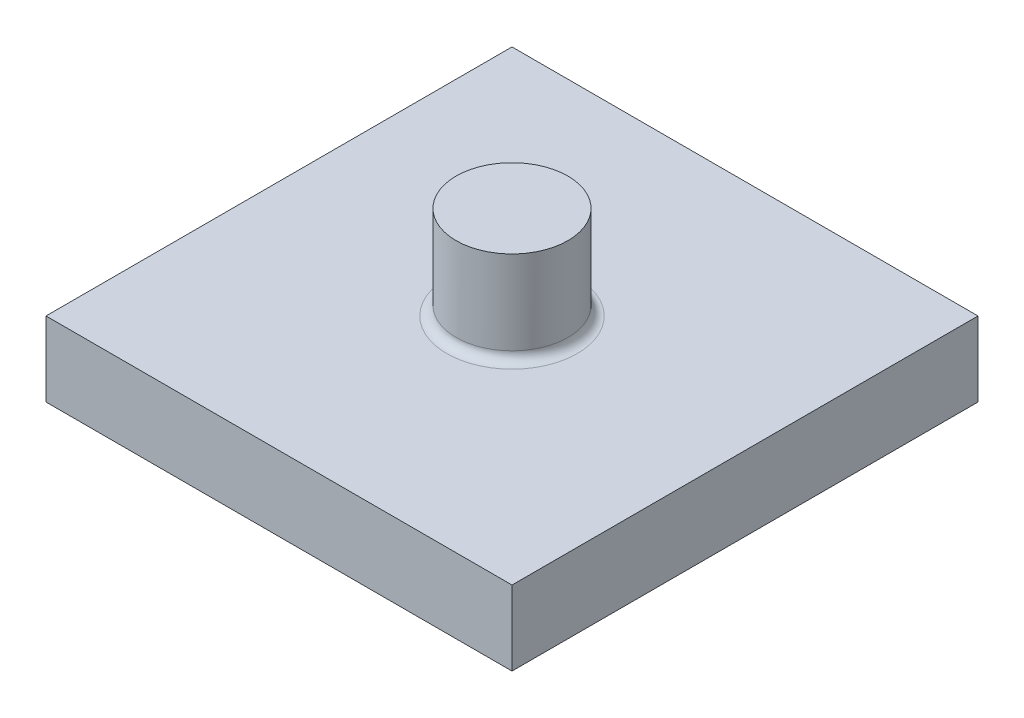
from build123d import *

# Parameters (mm, degrees)
CROQUIS1_W              = 25
CROQUIS1_H              = 25
SALIENTE_EXTRUIR1_DEPTH = 4
CROQUIS2_R              = 3
SALIENTE_EXTRUIR2_DEPTH = 5
REDONDEO1_R             = 0.5


with BuildPart() as part:
    # Croquis1 → Saliente-Extruir1 (new body)
    with BuildSketch(Plane(origin=(0, 0, 0), x_dir=(1, 0, 0), z_dir=(0, 1, 0))):
        Rectangle(CROQUIS1_W, CROQUIS1_H)
    extrude(amount=SALIENTE_EXTRUIR1_DEPTH)

    # Croquis2 → Saliente-Extruir2 (add)
    with BuildSketch(Plane(origin=(0, 4, 0), x_dir=(1, 0, 0), z_dir=(0, 1, 0))):
        with Locations(Location((0, 0, 0), (0, 0, 90))):
            Circle(CROQUIS2_R)
    extrude(amount=SALIENTE_EXTRUIR2_DEPTH)

    # Redondeo1
    redondeo1_edges = [part.edges().sort_by_distance(p)[0] for p in [
        (0, 4, 3),
    ]]
    fillet(redondeo1_edges, radius=REDONDEO1_R)


solid = part.part
